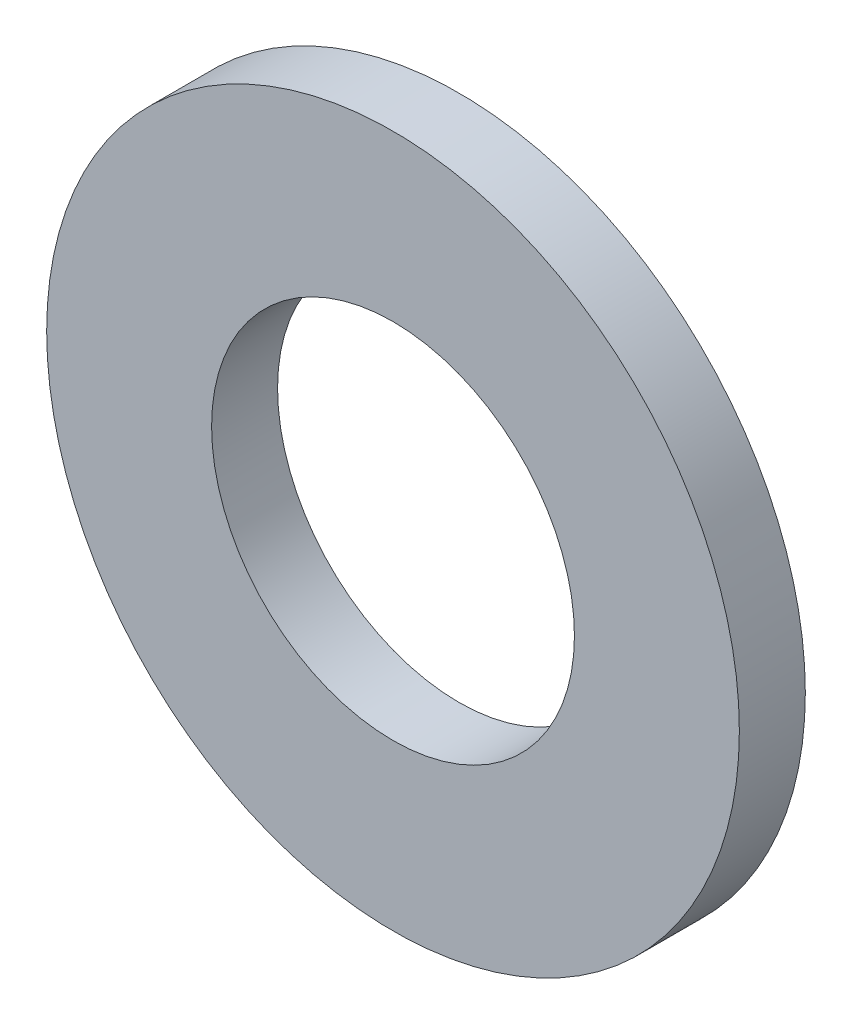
ISO-10303-21;
HEADER;
FILE_DESCRIPTION(('STEP AP214'),'2;1');
FILE_NAME('part.step','',(''),(''),'','','');
FILE_SCHEMA(('AUTOMOTIVE_DESIGN { 1 0 10303 214 1 1 1 1 }'));
ENDSEC;
DATA;
#1=APPLICATION_CONTEXT('core data for automotive mechanical design processes');
#2=APPLICATION_PROTOCOL_DEFINITION('international standard','automotive_design',2000,#1);
#3=PRODUCT_CONTEXT('',#1,'mechanical');
#4=PRODUCT('Part','Part','',(#3));
#5=PRODUCT_RELATED_PRODUCT_CATEGORY('part','',(#4));
#6=PRODUCT_DEFINITION_FORMATION('','',#4);
#7=PRODUCT_DEFINITION_CONTEXT('part definition',#1,'design');
#8=PRODUCT_DEFINITION('design','',#6,#7);
#9=PRODUCT_DEFINITION_SHAPE('','',#8);
#10=(LENGTH_UNIT() NAMED_UNIT(*) SI_UNIT(.MILLI.,.METRE.));
#11=(NAMED_UNIT(*) PLANE_ANGLE_UNIT() SI_UNIT($,.RADIAN.));
#12=(NAMED_UNIT(*) SI_UNIT($,.STERADIAN.) SOLID_ANGLE_UNIT());
#13=UNCERTAINTY_MEASURE_WITH_UNIT(LENGTH_MEASURE(1.E-05),#10,'distance_accuracy_value','');
#14=(GEOMETRIC_REPRESENTATION_CONTEXT(3) GLOBAL_UNCERTAINTY_ASSIGNED_CONTEXT((#13)) GLOBAL_UNIT_ASSIGNED_CONTEXT((#10,
#11,#12)) REPRESENTATION_CONTEXT('',''));
#15=CARTESIAN_POINT('',(0.,0.,0.));
#16=DIRECTION('',(0.,0.,1.));
#17=DIRECTION('',(1.,0.,0.));
#18=AXIS2_PLACEMENT_3D('',#15,#16,#17);
#19=CARTESIAN_POINT('',(0.,0.,0.));
#20=DIRECTION('',(0.,0.,1.));
#21=DIRECTION('',(1.,0.,0.));
#22=AXIS2_PLACEMENT_3D('',#19,#20,#21);
#23=PLANE('',#22);
#24=CARTESIAN_POINT('',(0.,0.,0.));
#25=DIRECTION('',(0.,0.,1.));
#26=DIRECTION('',(1.,0.,0.));
#27=AXIS2_PLACEMENT_3D('',#24,#25,#26);
#28=CIRCLE('',#27,10.5);
#29=CARTESIAN_POINT('',(10.5,0.,0.));
#30=VERTEX_POINT('',#29);
#31=EDGE_CURVE('E19',#30,#30,#28,.T.);
#32=ORIENTED_EDGE('',*,*,#31,.F.);
#33=EDGE_LOOP('',(#32));
#34=FACE_BOUND('',#33,.T.);
#35=CARTESIAN_POINT('',(0.,0.,0.));
#36=DIRECTION('',(0.,0.,1.));
#37=DIRECTION('',(0.,-1.,0.));
#38=AXIS2_PLACEMENT_3D('',#35,#36,#37);
#39=CIRCLE('',#38,5.5);
#40=CARTESIAN_POINT('',(0.,-5.5,0.));
#41=VERTEX_POINT('',#40);
#42=EDGE_CURVE('E27',#41,#41,#39,.T.);
#43=ORIENTED_EDGE('',*,*,#42,.T.);
#44=EDGE_LOOP('',(#43));
#45=FACE_BOUND('',#44,.T.);
#46=ADVANCED_FACE('F12',(#34,#45),#23,.F.);
#47=CARTESIAN_POINT('',(0.,0.,2.));
#48=DIRECTION('',(0.,0.,1.));
#49=DIRECTION('',(1.,0.,0.));
#50=AXIS2_PLACEMENT_3D('',#47,#48,#49);
#51=PLANE('',#50);
#52=CARTESIAN_POINT('',(0.,0.,2.));
#53=DIRECTION('',(0.,0.,1.));
#54=DIRECTION('',(1.,0.,0.));
#55=AXIS2_PLACEMENT_3D('',#52,#53,#54);
#56=CIRCLE('',#55,10.5);
#57=CARTESIAN_POINT('',(10.5,0.,2.));
#58=VERTEX_POINT('',#57);
#59=EDGE_CURVE('E8',#58,#58,#56,.T.);
#60=ORIENTED_EDGE('',*,*,#59,.T.);
#61=EDGE_LOOP('',(#60));
#62=FACE_BOUND('',#61,.T.);
#63=CARTESIAN_POINT('',(0.,0.,2.));
#64=DIRECTION('',(0.,0.,1.));
#65=DIRECTION('',(1.,0.,0.));
#66=AXIS2_PLACEMENT_3D('',#63,#64,#65);
#67=CIRCLE('',#66,5.5);
#68=CARTESIAN_POINT('',(5.5,0.,2.));
#69=VERTEX_POINT('',#68);
#70=EDGE_CURVE('E23',#69,#69,#67,.T.);
#71=ORIENTED_EDGE('',*,*,#70,.F.);
#72=EDGE_LOOP('',(#71));
#73=FACE_BOUND('',#72,.T.);
#74=ADVANCED_FACE('F43',(#62,#73),#51,.T.);
#75=CARTESIAN_POINT('',(0.,0.,2.));
#76=DIRECTION('',(0.,0.,-1.));
#77=DIRECTION('',(-1.,0.,0.));
#78=AXIS2_PLACEMENT_3D('',#75,#76,#77);
#79=CYLINDRICAL_SURFACE('',#78,10.5);
#80=ORIENTED_EDGE('',*,*,#59,.F.);
#81=EDGE_LOOP('',(#80));
#82=FACE_BOUND('',#81,.T.);
#83=ORIENTED_EDGE('',*,*,#31,.T.);
#84=EDGE_LOOP('',(#83));
#85=FACE_BOUND('',#84,.T.);
#86=ADVANCED_FACE('F14',(#82,#85),#79,.T.);
#87=CARTESIAN_POINT('',(0.,0.,2.));
#88=DIRECTION('',(0.,0.,-1.));
#89=DIRECTION('',(-1.,0.,0.));
#90=AXIS2_PLACEMENT_3D('',#87,#88,#89);
#91=CYLINDRICAL_SURFACE('',#90,5.5);
#92=ORIENTED_EDGE('',*,*,#70,.T.);
#93=EDGE_LOOP('',(#92));
#94=FACE_BOUND('',#93,.T.);
#95=ORIENTED_EDGE('',*,*,#42,.F.);
#96=EDGE_LOOP('',(#95));
#97=FACE_BOUND('',#96,.T.);
#98=ADVANCED_FACE('F34',(#94,#97),#91,.F.);
#99=CLOSED_SHELL('',(#46,#74,#86,#98));
#100=MANIFOLD_SOLID_BREP('B1',#99);
#101=ADVANCED_BREP_SHAPE_REPRESENTATION('',(#18,#100),#14);
#102=SHAPE_DEFINITION_REPRESENTATION(#9,#101);
ENDSEC;
END-ISO-10303-21;
